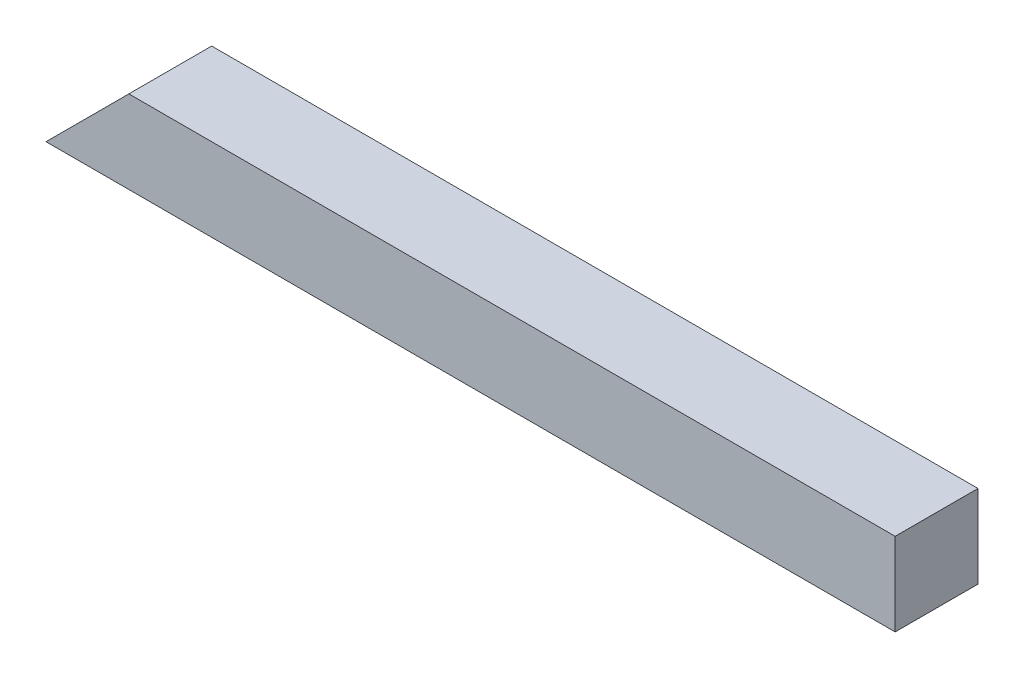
from build123d import *

# Parameters (mm, degrees)
BOSS_EXTRU_1_DEPTH = 40


with BuildPart() as part:
    # Esquisse1 → Boss.-Extru.1 (new body)
    with BuildSketch(Plane.XY):
        Polygon((40, 40), (410, 40), (410, 0), (0, 0), align=None)
    extrude(amount=-BOSS_EXTRU_1_DEPTH)


solid = part.part
